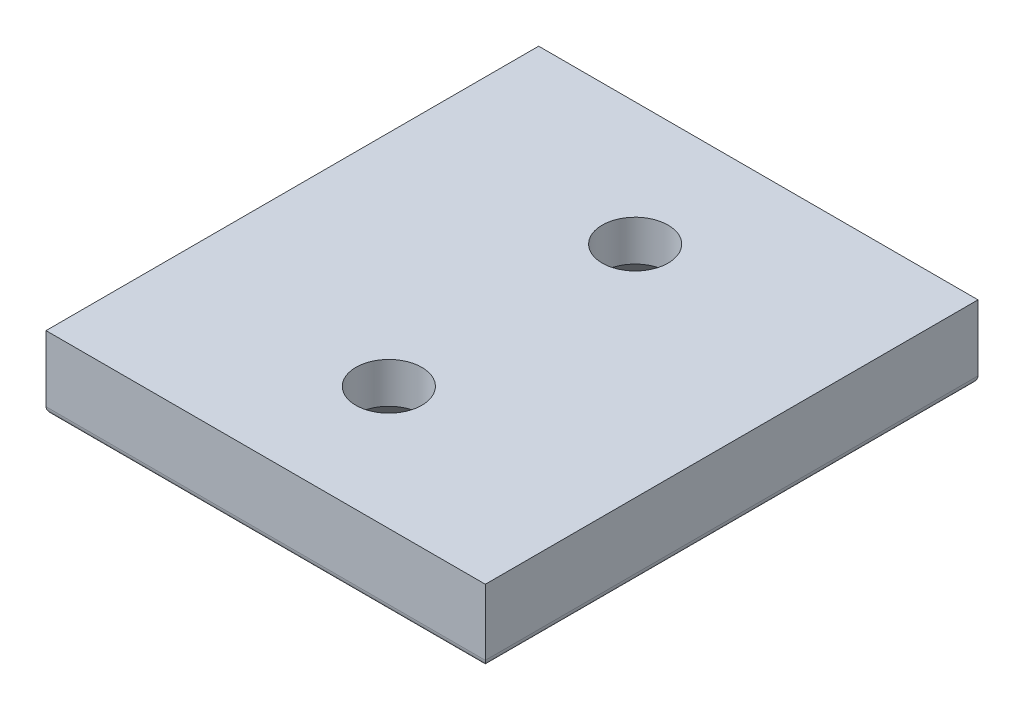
from build123d import *

# Parameters (mm, degrees)
SKETCH1_W                                            = 60
SKETCH1_H                                            = 67.28
BOSS_EXTRUDE1_DEPTH                                  = 10
FILLET1_R                                            = 1
CSK_FOR_M8_HEX_SOCKET_COUNTERSUNK_CAP_SC_D           = 9
CSK_FOR_M8_HEX_SOCKET_COUNTERSUNK_CAP_SC_CSINK_D     = 17.92
CSK_FOR_M8_HEX_SOCKET_COUNTERSUNK_CAP_SC_CSINK_ANGLE = 90


with BuildPart() as part:
    # Sketch1 → Boss-Extrude1 (new body)
    with BuildSketch(Plane(origin=(0, 0, 0), x_dir=(1, 0, 0), z_dir=(0, 1, 0))):
        Rectangle(SKETCH1_W, SKETCH1_H)
    extrude(amount=BOSS_EXTRUDE1_DEPTH)

    # Fillet1
    fillet1_edges = [part.edges().sort_by_distance(p)[0] for p in [
        (0, 0, 33.64),
        (-30, 0, 0),
        (0, 0, -33.64),
        (30, 0, 0),
    ]]
    fillet(fillet1_edges, radius=FILLET1_R)

    # CSK for M8 Hex Socket Countersunk Cap Sc (through all)
    with Locations(Plane(origin=(0, 0, 0), x_dir=(-1, 0, 0), z_dir=(0, -1, 0))):
        with Locations((0, 16.82), (0, -16.82)):
            CounterSinkHole(CSK_FOR_M8_HEX_SOCKET_COUNTERSUNK_CAP_SC_D / 2, CSK_FOR_M8_HEX_SOCKET_COUNTERSUNK_CAP_SC_CSINK_D / 2, counter_sink_angle=CSK_FOR_M8_HEX_SOCKET_COUNTERSUNK_CAP_SC_CSINK_ANGLE)


solid = part.part
